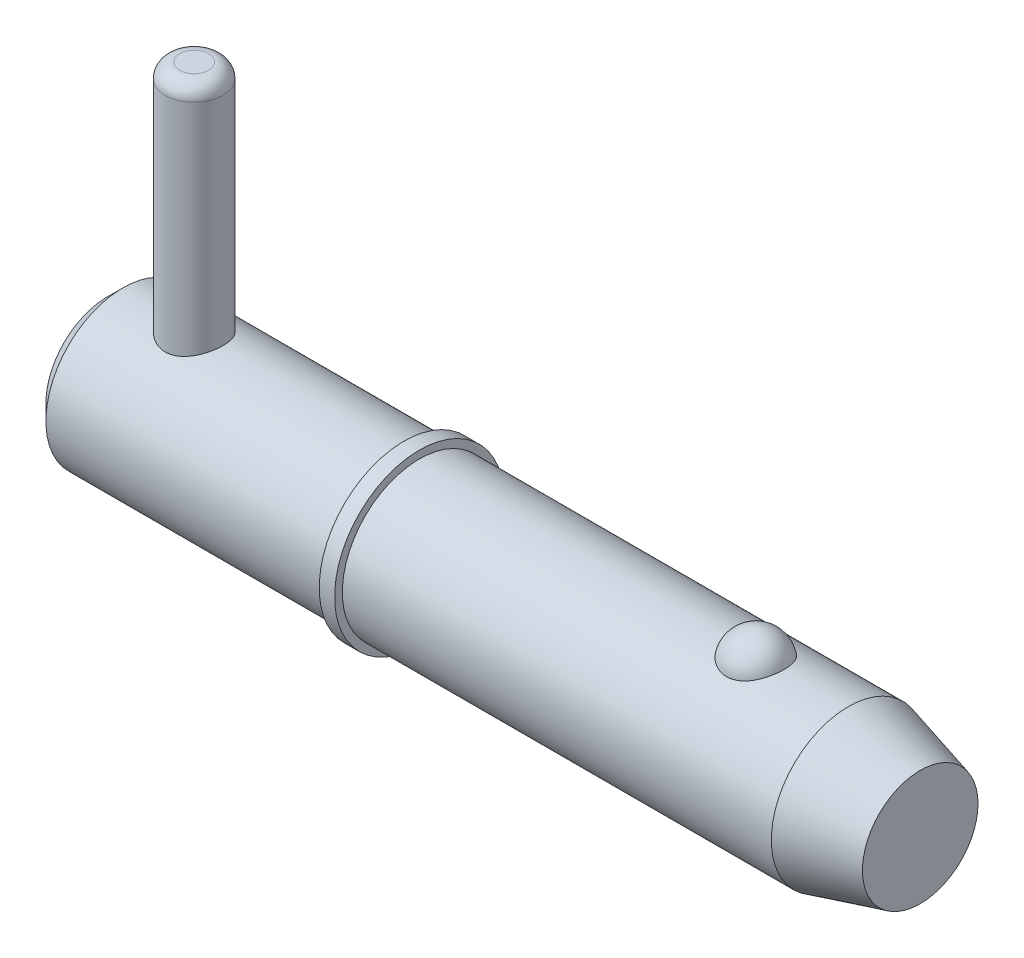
ISO-10303-21;
HEADER;
FILE_DESCRIPTION(('STEP AP214'),'2;1');
FILE_NAME('part.step','',(''),(''),'','','');
FILE_SCHEMA(('AUTOMOTIVE_DESIGN { 1 0 10303 214 1 1 1 1 }'));
ENDSEC;
DATA;
#1=APPLICATION_CONTEXT('core data for automotive mechanical design processes');
#2=APPLICATION_PROTOCOL_DEFINITION('international standard','automotive_design',2000,#1);
#3=PRODUCT_CONTEXT('',#1,'mechanical');
#4=PRODUCT('Part','Part','',(#3));
#5=PRODUCT_RELATED_PRODUCT_CATEGORY('part','',(#4));
#6=PRODUCT_DEFINITION_FORMATION('','',#4);
#7=PRODUCT_DEFINITION_CONTEXT('part definition',#1,'design');
#8=PRODUCT_DEFINITION('design','',#6,#7);
#9=PRODUCT_DEFINITION_SHAPE('','',#8);
#10=(LENGTH_UNIT() NAMED_UNIT(*) SI_UNIT(.MILLI.,.METRE.));
#11=(NAMED_UNIT(*) PLANE_ANGLE_UNIT() SI_UNIT($,.RADIAN.));
#12=(NAMED_UNIT(*) SI_UNIT($,.STERADIAN.) SOLID_ANGLE_UNIT());
#13=UNCERTAINTY_MEASURE_WITH_UNIT(LENGTH_MEASURE(1.E-05),#10,'distance_accuracy_value','');
#14=(GEOMETRIC_REPRESENTATION_CONTEXT(3) GLOBAL_UNCERTAINTY_ASSIGNED_CONTEXT((#13)) GLOBAL_UNIT_ASSIGNED_CONTEXT((#10,
#11,#12)) REPRESENTATION_CONTEXT('',''));
#15=CARTESIAN_POINT('',(0.,0.,0.));
#16=DIRECTION('',(0.,0.,1.));
#17=DIRECTION('',(1.,0.,0.));
#18=AXIS2_PLACEMENT_3D('',#15,#16,#17);
#19=CARTESIAN_POINT('',(7.14,25.4,0.));
#20=DIRECTION('',(0.,-1.,0.));
#21=DIRECTION('',(0.,0.,-1.));
#22=AXIS2_PLACEMENT_3D('',#19,#20,#21);
#23=CYLINDRICAL_SURFACE('',#22,2.38);
#24=CARTESIAN_POINT('',(7.14,-5.16,0.));
#25=DIRECTION('',(0.,1.,0.));
#26=DIRECTION('',(0.,0.,1.));
#27=AXIS2_PLACEMENT_3D('',#24,#25,#26);
#28=CIRCLE('',#27,2.38);
#29=CARTESIAN_POINT('',(7.14,-5.16,2.38));
#30=VERTEX_POINT('',#29);
#31=EDGE_CURVE('P0_E25',#30,#30,#28,.T.);
#32=ORIENTED_EDGE('',*,*,#31,.T.);
#33=EDGE_LOOP('',(#32));
#34=FACE_BOUND('',#33,.T.);
#35=CARTESIAN_POINT('',(7.14,24.21,0.));
#36=DIRECTION('',(0.,1.,0.));
#37=DIRECTION('',(0.,0.,1.));
#38=AXIS2_PLACEMENT_3D('',#35,#36,#37);
#39=CIRCLE('',#38,2.38);
#40=CARTESIAN_POINT('',(7.14,24.21,2.38));
#41=VERTEX_POINT('',#40);
#42=EDGE_CURVE('P0_E29',#41,#41,#39,.F.);
#43=ORIENTED_EDGE('',*,*,#42,.T.);
#44=EDGE_LOOP('',(#43));
#45=FACE_BOUND('',#44,.T.);
#46=ADVANCED_FACE('P0_F14',(#34,#45),#23,.T.);
#47=CARTESIAN_POINT('',(7.14,25.4,0.));
#48=DIRECTION('',(0.,1.,0.));
#49=DIRECTION('',(0.,0.,1.));
#50=AXIS2_PLACEMENT_3D('',#47,#48,#49);
#51=PLANE('',#50);
#52=CARTESIAN_POINT('',(7.14,25.4,0.));
#53=DIRECTION('',(0.,1.,0.));
#54=DIRECTION('',(0.,0.,1.));
#55=AXIS2_PLACEMENT_3D('',#52,#53,#54);
#56=CIRCLE('',#55,1.19);
#57=CARTESIAN_POINT('',(7.14,25.4,1.19));
#58=VERTEX_POINT('',#57);
#59=EDGE_CURVE('P0_E10',#58,#58,#56,.T.);
#60=ORIENTED_EDGE('',*,*,#59,.T.);
#61=EDGE_LOOP('',(#60));
#62=FACE_BOUND('',#61,.T.);
#63=ADVANCED_FACE('P0_F46',(#62),#51,.T.);
#64=CARTESIAN_POINT('',(7.14,-6.35,0.));
#65=DIRECTION('',(0.,1.,0.));
#66=DIRECTION('',(0.,0.,1.));
#67=AXIS2_PLACEMENT_3D('',#64,#65,#66);
#68=PLANE('',#67);
#69=CARTESIAN_POINT('',(7.14,-6.35,0.));
#70=DIRECTION('',(0.,1.,0.));
#71=DIRECTION('',(0.,0.,1.));
#72=AXIS2_PLACEMENT_3D('',#69,#70,#71);
#73=CIRCLE('',#72,1.19);
#74=CARTESIAN_POINT('',(7.14,-6.35,1.19));
#75=VERTEX_POINT('',#74);
#76=EDGE_CURVE('P0_E21',#75,#75,#73,.F.);
#77=ORIENTED_EDGE('',*,*,#76,.T.);
#78=EDGE_LOOP('',(#77));
#79=FACE_BOUND('',#78,.T.);
#80=ADVANCED_FACE('P0_F43',(#79),#68,.F.);
#81=CARTESIAN_POINT('',(7.14,-5.16,0.));
#82=DIRECTION('',(0.,1.,0.));
#83=DIRECTION('',(0.,0.,1.));
#84=AXIS2_PLACEMENT_3D('',#81,#82,#83);
#85=DEGENERATE_TOROIDAL_SURFACE('',#84,1.19,1.19,.T.);
#86=ORIENTED_EDGE('',*,*,#76,.F.);
#87=EDGE_LOOP('',(#86));
#88=FACE_BOUND('',#87,.T.);
#89=ORIENTED_EDGE('',*,*,#31,.F.);
#90=EDGE_LOOP('',(#89));
#91=FACE_BOUND('',#90,.T.);
#92=ADVANCED_FACE('P0_F38',(#88,#91),#85,.T.);
#93=CARTESIAN_POINT('',(7.14,24.21,0.));
#94=DIRECTION('',(0.,1.,0.));
#95=DIRECTION('',(0.,0.,1.));
#96=AXIS2_PLACEMENT_3D('',#93,#94,#95);
#97=DEGENERATE_TOROIDAL_SURFACE('',#96,1.19,1.19,.T.);
#98=ORIENTED_EDGE('',*,*,#42,.F.);
#99=EDGE_LOOP('',(#98));
#100=FACE_BOUND('',#99,.T.);
#101=ORIENTED_EDGE('',*,*,#59,.F.);
#102=EDGE_LOOP('',(#101));
#103=FACE_BOUND('',#102,.T.);
#104=ADVANCED_FACE('P0_F16',(#100,#103),#97,.T.);
#105=CLOSED_SHELL('',(#46,#63,#80,#92,#104));
#106=MANIFOLD_SOLID_BREP('P0_B1',#105);
#107=CARTESIAN_POINT('',(0.,0.,0.));
#108=DIRECTION('',(1.,0.,0.));
#109=DIRECTION('',(0.,0.,-1.));
#110=AXIS2_PLACEMENT_3D('',#107,#108,#109);
#111=CYLINDRICAL_SURFACE('',#110,6.35);
#112=CARTESIAN_POINT('',(61.0553693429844,0.,0.));
#113=DIRECTION('',(1.,0.,0.));
#114=DIRECTION('',(0.,0.,-1.));
#115=AXIS2_PLACEMENT_3D('',#112,#113,#114);
#116=CIRCLE('',#115,6.35);
#117=CARTESIAN_POINT('',(61.0553693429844,0.,-6.35));
#118=VERTEX_POINT('',#117);
#119=EDGE_CURVE('P1_E81',#118,#118,#116,.T.);
#120=ORIENTED_EDGE('',*,*,#119,.F.);
#121=EDGE_LOOP('',(#120));
#122=FACE_BOUND('',#121,.T.);
#123=CARTESIAN_POINT('',(25.7,0.,0.));
#124=DIRECTION('',(1.,0.,0.));
#125=DIRECTION('',(0.,0.,-1.));
#126=AXIS2_PLACEMENT_3D('',#123,#124,#125);
#127=CIRCLE('',#126,6.35);
#128=CARTESIAN_POINT('',(25.7,0.,-6.35));
#129=VERTEX_POINT('',#128);
#130=EDGE_CURVE('P1_E85',#129,#129,#127,.T.);
#131=ORIENTED_EDGE('',*,*,#130,.T.);
#132=EDGE_LOOP('',(#131));
#133=FACE_BOUND('',#132,.T.);
#134=CARTESIAN_POINT('',(53.4300214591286,5.87502187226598,2.40969251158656));
#135=CARTESIAN_POINT('',(53.3050305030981,5.87501645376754,2.40969773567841));
#136=CARTESIAN_POINT('',(53.1800806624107,5.87916061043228,2.39967292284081));
#137=CARTESIAN_POINT('',(52.9339091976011,5.89523112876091,2.35991730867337));
#138=CARTESIAN_POINT('',(52.8126863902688,5.90715499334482,2.33019283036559));
#139=CARTESIAN_POINT('',(52.5775170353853,5.9373956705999,2.25201402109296));
#140=CARTESIAN_POINT('',(52.4635602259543,5.95570321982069,2.20358681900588));
#141=CARTESIAN_POINT('',(52.24557352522,5.99672067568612,2.08937987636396));
#142=CARTESIAN_POINT('',(52.1415457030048,6.01943149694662,2.02359652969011));
#143=CARTESIAN_POINT('',(51.9429437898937,6.06760647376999,1.87428969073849));
#144=CARTESIAN_POINT('',(51.8487268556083,6.09313095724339,1.79031110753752));
#145=CARTESIAN_POINT('',(51.6752557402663,6.14375873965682,1.60800178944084));
#146=CARTESIAN_POINT('',(51.5960043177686,6.16886196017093,1.50966841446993));
#147=CARTESIAN_POINT('',(51.4508457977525,6.2172460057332,1.29645884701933));
#148=CARTESIAN_POINT('',(51.3856885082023,6.24039621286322,1.18104158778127));
#149=CARTESIAN_POINT('',(51.2747035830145,6.28117277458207,0.940351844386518));
#150=CARTESIAN_POINT('',(51.2288776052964,6.29879865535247,0.815078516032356));
#151=CARTESIAN_POINT('',(51.1570234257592,6.32692073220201,0.556494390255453));
#152=CARTESIAN_POINT('',(51.131249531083,6.33732517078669,0.423102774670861));
#153=CARTESIAN_POINT('',(51.1009885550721,6.34957673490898,0.153542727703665));
#154=CARTESIAN_POINT('',(51.0965009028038,6.35142408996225,0.0173743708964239));
#155=CARTESIAN_POINT('',(51.1088655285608,6.34638925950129,-0.253036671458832));
#156=CARTESIAN_POINT('',(51.1255949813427,6.33955731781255,-0.387285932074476));
#157=CARTESIAN_POINT('',(51.179843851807,6.31794129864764,-0.650851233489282));
#158=CARTESIAN_POINT('',(51.2173636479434,6.30315707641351,-0.780167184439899));
#159=CARTESIAN_POINT('',(51.312500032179,6.26711642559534,-1.03041949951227));
#160=CARTESIAN_POINT('',(51.370143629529,6.24585130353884,-1.1513443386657));
#161=CARTESIAN_POINT('',(51.5043522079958,6.19905619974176,-1.38129800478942));
#162=CARTESIAN_POINT('',(51.5809187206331,6.17352587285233,-1.49032586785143));
#163=CARTESIAN_POINT('',(51.7517538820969,6.12080227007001,-1.69393164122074));
#164=CARTESIAN_POINT('',(51.8461008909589,6.09360200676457,-1.78844209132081));
#165=CARTESIAN_POINT('',(52.0501196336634,6.0407043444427,-1.95970536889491));
#166=CARTESIAN_POINT('',(52.1597900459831,6.01500681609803,-2.03645972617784));
#167=CARTESIAN_POINT('',(52.3891876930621,5.96867714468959,-2.16845644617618));
#168=CARTESIAN_POINT('',(52.5086522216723,5.94794910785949,-2.22412062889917));
#169=CARTESIAN_POINT('',(52.7562188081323,5.91340580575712,-2.31440992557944));
#170=CARTESIAN_POINT('',(52.8843175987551,5.89958794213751,-2.34904294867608));
#171=CARTESIAN_POINT('',(53.138582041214,5.88111049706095,-2.39491590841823));
#172=CARTESIAN_POINT('',(53.2645207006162,5.876025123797,-2.40724512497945));
#173=CARTESIAN_POINT('',(53.5167867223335,5.87428980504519,-2.41147867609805));
#174=CARTESIAN_POINT('',(53.643114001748,5.87763817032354,-2.40338710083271));
#175=CARTESIAN_POINT('',(53.8884170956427,5.89212921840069,-2.36762715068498));
#176=CARTESIAN_POINT('',(54.0074992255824,5.90302431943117,-2.34058030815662));
#177=CARTESIAN_POINT('',(54.2392447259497,5.93113752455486,-2.2683906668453));
#178=CARTESIAN_POINT('',(54.3519075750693,5.94835614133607,-2.22324640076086));
#179=CARTESIAN_POINT('',(54.5704009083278,5.98773016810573,-2.11493806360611));
#180=CARTESIAN_POINT('',(54.6760289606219,6.00998499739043,-2.05140269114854));
#181=CARTESIAN_POINT('',(54.8753006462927,6.0569014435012,-1.90842705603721));
#182=CARTESIAN_POINT('',(54.9689415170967,6.08156361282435,-1.82898313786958));
#183=CARTESIAN_POINT('',(55.1466754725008,6.13211715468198,-1.65182429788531));
#184=CARTESIAN_POINT('',(55.230055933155,6.15800825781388,-1.55339381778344));
#185=CARTESIAN_POINT('',(55.3797900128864,6.20712834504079,-1.34374214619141));
#186=CARTESIAN_POINT('',(55.4461405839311,6.23035685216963,-1.23251867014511));
#187=CARTESIAN_POINT('',(55.5623455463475,6.27251177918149,-0.996447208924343));
#188=CARTESIAN_POINT('',(55.6116072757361,6.29127762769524,-0.871278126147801));
#189=CARTESIAN_POINT('',(55.6896142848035,6.3215862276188,-0.613870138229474));
#190=CARTESIAN_POINT('',(55.7183593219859,6.33312889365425,-0.481631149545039));
#191=CARTESIAN_POINT('',(55.7547705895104,6.34782349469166,-0.213672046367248));
#192=CARTESIAN_POINT('',(55.7624134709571,6.35096613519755,-0.0779482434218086));
#193=CARTESIAN_POINT('',(55.7563951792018,6.34851322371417,0.192943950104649));
#194=CARTESIAN_POINT('',(55.7427343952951,6.3429178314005,0.328112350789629));
#195=CARTESIAN_POINT('',(55.6945036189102,6.32360512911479,0.593406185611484));
#196=CARTESIAN_POINT('',(55.6600313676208,6.30992579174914,0.723552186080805));
#197=CARTESIAN_POINT('',(55.5709539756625,6.27586325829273,0.975834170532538));
#198=CARTESIAN_POINT('',(55.5163476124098,6.25547965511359,1.09796966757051));
#199=CARTESIAN_POINT('',(55.3877587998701,6.20998183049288,1.33148921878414));
#200=CARTESIAN_POINT('',(55.3136742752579,6.18484288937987,1.44281227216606));
#201=CARTESIAN_POINT('',(55.1478204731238,6.13258735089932,1.65087683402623));
#202=CARTESIAN_POINT('',(55.0560515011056,6.10547078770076,1.74761859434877));
#203=CARTESIAN_POINT('',(54.8571839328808,6.05235879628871,1.92350926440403));
#204=CARTESIAN_POINT('',(54.750133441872,6.02636017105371,2.00271146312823));
#205=CARTESIAN_POINT('',(54.5231384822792,5.97843747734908,2.14154159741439));
#206=CARTESIAN_POINT('',(54.403191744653,5.95651412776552,2.2011660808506));
#207=CARTESIAN_POINT('',(54.1445236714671,5.91812106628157,2.30250570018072));
#208=CARTESIAN_POINT('',(54.0050698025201,5.90217533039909,2.34256795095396));
#209=CARTESIAN_POINT('',(53.7203974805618,5.88063128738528,2.39615214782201));
#210=CARTESIAN_POINT('',(53.5751817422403,5.87502816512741,2.40968644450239));
#211=CARTESIAN_POINT('',(53.4300214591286,5.87502187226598,2.40969251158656));
#212=B_SPLINE_CURVE_WITH_KNOTS('',3,(#134,#135,#136,#137,#138,#139,#140,#141,#142,#143,#144,
#145,#146,#147,#148,#149,#150,#151,#152,#153,#154,#155,#156,#157,#158,#159,#160,#161,#162,#163,
#164,#165,#166,#167,#168,#169,#170,#171,#172,#173,#174,#175,#176,#177,#178,#179,#180,#181,#182,
#183,#184,#185,#186,#187,#188,#189,#190,#191,#192,#193,#194,#195,#196,#197,#198,#199,#200,#201,
#202,#203,#204,#205,#206,#207,#208,#209,#210,#211),.UNSPECIFIED.,.T.,.F.,(4,2,2,2,2,2,2,2,2,2,2,
2,2,2,2,2,2,2,2,2,2,2,2,2,2,2,2,2,2,2,2,2,2,2,2,2,2,2,4),(0.,0.374440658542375,
0.748761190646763,1.12254078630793,1.49639810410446,1.88098871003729,2.26565013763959,
2.66741104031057,3.0692063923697,3.47601794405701,3.88281858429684,4.28727498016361,
4.69173873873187,5.09674745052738,5.50178895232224,5.90865911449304,6.31549420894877,
6.71369855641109,7.11175305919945,7.48978077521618,7.86773278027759,8.23383886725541,
8.59997464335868,8.97409044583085,9.34829231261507,9.7412266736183,10.1342313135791,
10.539752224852,10.945277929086,11.3512521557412,11.7572189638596,12.1612938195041,
12.5653932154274,12.9716540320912,13.37790783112,13.782909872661,14.1879832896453,
14.6230486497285,15.0579114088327),.UNSPECIFIED.);
#213=CARTESIAN_POINT('',(53.4300214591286,5.87502187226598,2.40969251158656));
#214=VERTEX_POINT('',#213);
#215=EDGE_CURVE('P1_E35',#214,#214,#212,.T.);
#216=ORIENTED_EDGE('',*,*,#215,.T.);
#217=EDGE_LOOP('',(#216));
#218=FACE_BOUND('',#217,.T.);
#219=ADVANCED_FACE('P1_F13',(#122,#133,#218),#111,.T.);
#220=CARTESIAN_POINT('',(0.,0.,0.));
#221=DIRECTION('',(-1.,0.,0.));
#222=DIRECTION('',(0.,0.,1.));
#223=AXIS2_PLACEMENT_3D('',#220,#221,#222);
#224=PLANE('',#223);
#225=CARTESIAN_POINT('',(0.,0.,0.));
#226=DIRECTION('',(1.,0.,0.));
#227=DIRECTION('',(0.,0.,-1.));
#228=AXIS2_PLACEMENT_3D('',#225,#226,#227);
#229=CIRCLE('',#228,5.08);
#230=CARTESIAN_POINT('',(0.,0.,-5.08));
#231=VERTEX_POINT('',#230);
#232=EDGE_CURVE('P1_E9',#231,#231,#229,.T.);
#233=ORIENTED_EDGE('',*,*,#232,.F.);
#234=EDGE_LOOP('',(#233));
#235=FACE_BOUND('',#234,.T.);
#236=ADVANCED_FACE('P1_F15',(#235),#224,.T.);
#237=CARTESIAN_POINT('',(1.27,0.,0.));
#238=DIRECTION('',(1.,0.,0.));
#239=DIRECTION('',(0.,0.,-1.));
#240=AXIS2_PLACEMENT_3D('',#237,#238,#239);
#241=CONICAL_SURFACE('',#240,6.35,0.78539816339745);
#242=ORIENTED_EDGE('',*,*,#232,.T.);
#243=EDGE_LOOP('',(#242));
#244=FACE_BOUND('',#243,.T.);
#245=CARTESIAN_POINT('',(1.27,0.,0.));
#246=DIRECTION('',(1.,0.,0.));
#247=DIRECTION('',(0.,0.,-1.));
#248=AXIS2_PLACEMENT_3D('',#245,#246,#247);
#249=CIRCLE('',#248,6.35);
#250=CARTESIAN_POINT('',(1.27,0.,-6.35));
#251=VERTEX_POINT('',#250);
#252=EDGE_CURVE('P1_E26',#251,#251,#249,.T.);
#253=ORIENTED_EDGE('',*,*,#252,.F.);
#254=EDGE_LOOP('',(#253));
#255=FACE_BOUND('',#254,.T.);
#256=ADVANCED_FACE('P1_F77',(#244,#255),#241,.T.);
#257=CARTESIAN_POINT('',(0.,0.,0.));
#258=DIRECTION('',(1.,0.,0.));
#259=DIRECTION('',(0.,0.,-1.));
#260=AXIS2_PLACEMENT_3D('',#257,#258,#259);
#261=CYLINDRICAL_SURFACE('',#260,6.35);
#262=CARTESIAN_POINT('',(7.14,-5.88711304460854,2.38));
#263=CARTESIAN_POINT('',(7.01146258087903,-5.88710856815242,2.38000480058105));
#264=CARTESIAN_POINT('',(6.88295682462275,-5.89136840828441,2.36955244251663));
#265=CARTESIAN_POINT('',(6.62981934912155,-5.90782785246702,2.32820953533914));
#266=CARTESIAN_POINT('',(6.50518751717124,-5.92002722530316,2.29731958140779));
#267=CARTESIAN_POINT('',(6.26352403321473,-5.95079384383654,2.21639366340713));
#268=CARTESIAN_POINT('',(6.14647496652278,-5.96934583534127,2.16640353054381));
#269=CARTESIAN_POINT('',(5.92237941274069,-6.01070278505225,2.04885862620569));
#270=CARTESIAN_POINT('',(5.81533593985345,-6.03350901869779,1.98129858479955));
#271=CARTESIAN_POINT('',(5.60897525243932,-6.08207341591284,1.82693902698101));
#272=CARTESIAN_POINT('',(5.51022503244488,-6.10791836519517,1.73940861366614));
#273=CARTESIAN_POINT('',(5.32840561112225,-6.15892405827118,1.54914379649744));
#274=CARTESIAN_POINT('',(5.24533975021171,-6.1840846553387,1.44640616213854));
#275=CARTESIAN_POINT('',(5.09451639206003,-6.23191821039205,1.22434014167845));
#276=CARTESIAN_POINT('',(5.02737511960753,-6.25447755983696,1.10456656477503));
#277=CARTESIAN_POINT('',(4.91443001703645,-6.2935236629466,0.854429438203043));
#278=CARTESIAN_POINT('',(4.86861879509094,-6.31001251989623,0.724069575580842));
#279=CARTESIAN_POINT('',(4.80162253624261,-6.33444370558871,0.46242122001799));
#280=CARTESIAN_POINT('',(4.77946137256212,-6.34272370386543,0.331414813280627));
#281=CARTESIAN_POINT('',(4.75726677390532,-6.35101600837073,0.0672982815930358));
#282=CARTESIAN_POINT('',(4.75722615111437,-6.35103100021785,-0.0658111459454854));
#283=CARTESIAN_POINT('',(4.77870510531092,-6.3430064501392,-0.323358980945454));
#284=CARTESIAN_POINT('',(4.79915922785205,-6.33536494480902,-0.447900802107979));
#285=CARTESIAN_POINT('',(4.85925493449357,-6.31340794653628,-0.69163609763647));
#286=CARTESIAN_POINT('',(4.89889787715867,-6.29909198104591,-0.810829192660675));
#287=CARTESIAN_POINT('',(4.9967414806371,-6.26494471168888,-1.04254212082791));
#288=CARTESIAN_POINT('',(5.05520370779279,-6.24503620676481,-1.1549396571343));
#289=CARTESIAN_POINT('',(5.1887948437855,-6.20171869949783,-1.3686079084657));
#290=CARTESIAN_POINT('',(5.26392912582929,-6.17830856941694,-1.46987502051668));
#291=CARTESIAN_POINT('',(5.43386591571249,-6.12878580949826,-1.66468415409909));
#292=CARTESIAN_POINT('',(5.52956139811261,-6.10259519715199,-1.75742857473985));
#293=CARTESIAN_POINT('',(5.73530435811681,-6.05155777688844,-1.92585331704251));
#294=CARTESIAN_POINT('',(5.84535542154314,-6.02671130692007,-2.00152936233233));
#295=CARTESIAN_POINT('',(6.07982989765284,-5.98068420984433,-2.13519109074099));
#296=CARTESIAN_POINT('',(6.20451768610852,-5.95959698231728,-2.19274775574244));
#297=CARTESIAN_POINT('',(6.4628145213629,-5.92455622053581,-2.28574558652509));
#298=CARTESIAN_POINT('',(6.59641856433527,-5.91059872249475,-2.32119904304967));
#299=CARTESIAN_POINT('',(6.86087441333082,-5.8923327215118,-2.36717069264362));
#300=CARTESIAN_POINT('',(6.99147192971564,-5.8875347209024,-2.37895573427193));
#301=CARTESIAN_POINT('',(7.25283805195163,-5.88674545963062,-2.38091046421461));
#302=CARTESIAN_POINT('',(7.38360660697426,-5.89075200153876,-2.37108554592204));
#303=CARTESIAN_POINT('',(7.63510696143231,-5.90662331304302,-2.33124781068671));
#304=CARTESIAN_POINT('',(7.75602069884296,-5.91810660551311,-2.30221396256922));
#305=CARTESIAN_POINT('',(7.99120505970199,-5.94718527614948,-2.22601401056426));
#306=CARTESIAN_POINT('',(8.10547431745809,-5.96478190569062,-2.17884419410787));
#307=CARTESIAN_POINT('',(8.32888632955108,-6.00491533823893,-2.06572311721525));
#308=CARTESIAN_POINT('',(8.43767672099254,-6.02761250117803,-1.99913452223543));
#309=CARTESIAN_POINT('',(8.6429894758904,-6.07511988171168,-1.84974438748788));
#310=CARTESIAN_POINT('',(8.73950733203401,-6.09993087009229,-1.76693691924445));
#311=CARTESIAN_POINT('',(8.9238741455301,-6.1507686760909,-1.58125563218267));
#312=CARTESIAN_POINT('',(9.01078732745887,-6.17677301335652,-1.47744327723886));
#313=CARTESIAN_POINT('',(9.16607127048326,-6.22556172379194,-1.25606967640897));
#314=CARTESIAN_POINT('',(9.23444197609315,-6.24834608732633,-1.13850838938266));
#315=CARTESIAN_POINT('',(9.3502493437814,-6.28811144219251,-0.893050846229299));
#316=CARTESIAN_POINT('',(9.39775808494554,-6.30511236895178,-0.765192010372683));
#317=CARTESIAN_POINT('',(9.47032640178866,-6.33145833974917,-0.502514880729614));
#318=CARTESIAN_POINT('',(9.49539651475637,-6.34080697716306,-0.367699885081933));
#319=CARTESIAN_POINT('',(9.52124059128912,-6.35045496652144,-0.103396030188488));
#320=CARTESIAN_POINT('',(9.52334421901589,-6.35124952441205,0.025945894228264));
#321=CARTESIAN_POINT('',(9.50661518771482,-6.34499064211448,0.283061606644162));
#322=CARTESIAN_POINT('',(9.48778504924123,-6.33793814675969,0.410835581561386));
#323=CARTESIAN_POINT('',(9.43065630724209,-6.31700307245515,0.658028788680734));
#324=CARTESIAN_POINT('',(9.39284291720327,-6.30329098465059,0.7775756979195));
#325=CARTESIAN_POINT('',(9.29930406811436,-6.27046903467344,1.00863789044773));
#326=CARTESIAN_POINT('',(9.2435752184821,-6.25135815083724,1.12015164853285));
#327=CARTESIAN_POINT('',(9.11312349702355,-6.20865254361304,1.33711407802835));
#328=CARTESIAN_POINT('',(9.03770094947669,-6.18490316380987,1.44211105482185));
#329=CARTESIAN_POINT('',(8.87110640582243,-6.13583718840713,1.63836897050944));
#330=CARTESIAN_POINT('',(8.77992879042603,-6.11052003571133,1.72962498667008));
#331=CARTESIAN_POINT('',(8.57869799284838,-6.05953829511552,1.90076098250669));
#332=CARTESIAN_POINT('',(8.46790320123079,-6.03392573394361,1.97978778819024));
#333=CARTESIAN_POINT('',(8.23379693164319,-5.98676607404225,2.11813466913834));
#334=CARTESIAN_POINT('',(8.11048418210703,-5.9652193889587,2.17745273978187));
#335=CARTESIAN_POINT('',(7.84900037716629,-5.92818393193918,2.27641807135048));
#336=CARTESIAN_POINT('',(7.71041678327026,-5.91299857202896,2.31510015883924));
#337=CARTESIAN_POINT('',(7.42787316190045,-5.89246887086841,2.36688002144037));
#338=CARTESIAN_POINT('',(7.28391673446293,-5.88711805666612,2.37999462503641));
#339=CARTESIAN_POINT('',(7.14,-5.88711304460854,2.38));
#340=B_SPLINE_CURVE_WITH_KNOTS('',3,(#262,#263,#264,#265,#266,#267,#268,#269,#270,#271,#272,
#273,#274,#275,#276,#277,#278,#279,#280,#281,#282,#283,#284,#285,#286,#287,#288,#289,#290,#291,
#292,#293,#294,#295,#296,#297,#298,#299,#300,#301,#302,#303,#304,#305,#306,#307,#308,#309,#310,
#311,#312,#313,#314,#315,#316,#317,#318,#319,#320,#321,#322,#323,#324,#325,#326,#327,#328,#329,
#330,#331,#332,#333,#334,#335,#336,#337,#338,#339),.UNSPECIFIED.,.T.,.F.,(4,2,2,2,2,2,2,2,2,2,2,
2,2,2,2,2,2,2,2,2,2,2,2,2,2,2,2,2,2,2,2,2,2,2,2,2,2,2,4),(0.,0.385076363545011,
0.770141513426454,1.15428843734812,1.53855071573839,1.94016118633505,2.3418570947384,
2.75720522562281,3.1724093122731,3.569721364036,3.96690431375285,4.34445758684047,
4.72203759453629,5.10511017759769,5.48830640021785,5.89390240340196,6.29959991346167,
6.71428455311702,7.12873839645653,7.52034494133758,7.91185376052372,8.28480528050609,
8.65783318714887,9.0448340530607,9.43197664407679,9.84363087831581,10.2552863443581,
10.6655081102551,11.0755371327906,11.4616919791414,11.847800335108,12.224507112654,
12.6012852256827,12.9938941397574,13.386643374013,13.8000944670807,14.2135876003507,
14.6450218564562,15.0761720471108),.UNSPECIFIED.);
#341=CARTESIAN_POINT('',(7.14,-5.88711304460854,2.38));
#342=VERTEX_POINT('',#341);
#343=EDGE_CURVE('P1_E17',#342,#342,#340,.T.);
#344=ORIENTED_EDGE('',*,*,#343,.F.);
#345=EDGE_LOOP('',(#344));
#346=FACE_BOUND('',#345,.T.);
#347=CARTESIAN_POINT('',(7.14,5.88711304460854,2.38));
#348=CARTESIAN_POINT('',(7.26853741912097,5.88710856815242,2.38000480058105));
#349=CARTESIAN_POINT('',(7.39704317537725,5.89136840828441,2.36955244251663));
#350=CARTESIAN_POINT('',(7.65018065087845,5.90782785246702,2.32820953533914));
#351=CARTESIAN_POINT('',(7.77481248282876,5.92002722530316,2.29731958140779));
#352=CARTESIAN_POINT('',(8.01647596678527,5.95079384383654,2.21639366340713));
#353=CARTESIAN_POINT('',(8.13352503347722,5.96934583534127,2.16640353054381));
#354=CARTESIAN_POINT('',(8.35762058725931,6.01070278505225,2.04885862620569));
#355=CARTESIAN_POINT('',(8.46466406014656,6.03350901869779,1.98129858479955));
#356=CARTESIAN_POINT('',(8.67102474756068,6.08207341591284,1.82693902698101));
#357=CARTESIAN_POINT('',(8.76977496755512,6.10791836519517,1.73940861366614));
#358=CARTESIAN_POINT('',(8.95159438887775,6.15892405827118,1.54914379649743));
#359=CARTESIAN_POINT('',(9.03466024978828,6.1840846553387,1.44640616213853));
#360=CARTESIAN_POINT('',(9.18548360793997,6.23191821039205,1.22434014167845));
#361=CARTESIAN_POINT('',(9.25262488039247,6.25447755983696,1.10456656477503));
#362=CARTESIAN_POINT('',(9.36556998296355,6.2935236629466,0.854429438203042));
#363=CARTESIAN_POINT('',(9.41138120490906,6.31001251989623,0.72406957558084));
#364=CARTESIAN_POINT('',(9.47837746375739,6.33444370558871,0.462421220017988));
#365=CARTESIAN_POINT('',(9.50053862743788,6.34272370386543,0.331414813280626));
#366=CARTESIAN_POINT('',(9.52273322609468,6.35101600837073,0.0672982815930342));
#367=CARTESIAN_POINT('',(9.52277384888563,6.35103100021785,-0.0658111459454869));
#368=CARTESIAN_POINT('',(9.50129489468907,6.3430064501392,-0.323358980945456));
#369=CARTESIAN_POINT('',(9.48084077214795,6.33536494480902,-0.447900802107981));
#370=CARTESIAN_POINT('',(9.42074506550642,6.31340794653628,-0.691636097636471));
#371=CARTESIAN_POINT('',(9.38110212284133,6.29909198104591,-0.810829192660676));
#372=CARTESIAN_POINT('',(9.2832585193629,6.26494471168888,-1.04254212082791));
#373=CARTESIAN_POINT('',(9.22479629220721,6.24503620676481,-1.1549396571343));
#374=CARTESIAN_POINT('',(9.0912051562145,6.20171869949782,-1.3686079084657));
#375=CARTESIAN_POINT('',(9.0160708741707,6.17830856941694,-1.46987502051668));
#376=CARTESIAN_POINT('',(8.84613408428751,6.12878580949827,-1.66468415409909));
#377=CARTESIAN_POINT('',(8.75043860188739,6.10259519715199,-1.75742857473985));
#378=CARTESIAN_POINT('',(8.54469564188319,6.05155777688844,-1.92585331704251));
#379=CARTESIAN_POINT('',(8.43464457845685,6.02671130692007,-2.00152936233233));
#380=CARTESIAN_POINT('',(8.20017010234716,5.98068420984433,-2.13519109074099));
#381=CARTESIAN_POINT('',(8.07548231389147,5.95959698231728,-2.19274775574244));
#382=CARTESIAN_POINT('',(7.8171854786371,5.9245562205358,-2.28574558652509));
#383=CARTESIAN_POINT('',(7.68358143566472,5.91059872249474,-2.32119904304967));
#384=CARTESIAN_POINT('',(7.41912558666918,5.8923327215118,-2.36717069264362));
#385=CARTESIAN_POINT('',(7.28852807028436,5.8875347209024,-2.37895573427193));
#386=CARTESIAN_POINT('',(7.02716194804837,5.88674545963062,-2.38091046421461));
#387=CARTESIAN_POINT('',(6.89639339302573,5.89075200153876,-2.37108554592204));
#388=CARTESIAN_POINT('',(6.64489303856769,5.90662331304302,-2.33124781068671));
#389=CARTESIAN_POINT('',(6.52397930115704,5.91810660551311,-2.30221396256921));
#390=CARTESIAN_POINT('',(6.288794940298,5.94718527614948,-2.22601401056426));
#391=CARTESIAN_POINT('',(6.17452568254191,5.96478190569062,-2.17884419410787));
#392=CARTESIAN_POINT('',(5.95111367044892,6.00491533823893,-2.06572311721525));
#393=CARTESIAN_POINT('',(5.84232327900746,6.02761250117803,-1.99913452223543));
#394=CARTESIAN_POINT('',(5.6370105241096,6.07511988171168,-1.84974438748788));
#395=CARTESIAN_POINT('',(5.54049266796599,6.09993087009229,-1.76693691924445));
#396=CARTESIAN_POINT('',(5.3561258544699,6.1507686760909,-1.58125563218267));
#397=CARTESIAN_POINT('',(5.26921267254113,6.17677301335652,-1.47744327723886));
#398=CARTESIAN_POINT('',(5.11392872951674,6.22556172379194,-1.25606967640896));
#399=CARTESIAN_POINT('',(5.04555802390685,6.24834608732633,-1.13850838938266));
#400=CARTESIAN_POINT('',(4.9297506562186,6.28811144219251,-0.893050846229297));
#401=CARTESIAN_POINT('',(4.88224191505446,6.30511236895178,-0.76519201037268));
#402=CARTESIAN_POINT('',(4.80967359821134,6.33145833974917,-0.502514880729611));
#403=CARTESIAN_POINT('',(4.78460348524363,6.34080697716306,-0.36769988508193));
#404=CARTESIAN_POINT('',(4.75875940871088,6.35045496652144,-0.103396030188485));
#405=CARTESIAN_POINT('',(4.75665578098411,6.35124952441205,0.025945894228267));
#406=CARTESIAN_POINT('',(4.77338481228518,6.34499064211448,0.283061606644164));
#407=CARTESIAN_POINT('',(4.79221495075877,6.33793814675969,0.410835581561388));
#408=CARTESIAN_POINT('',(4.84934369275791,6.31700307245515,0.658028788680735));
#409=CARTESIAN_POINT('',(4.88715708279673,6.30329098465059,0.777575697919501));
#410=CARTESIAN_POINT('',(4.98069593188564,6.27046903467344,1.00863789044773));
#411=CARTESIAN_POINT('',(5.0364247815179,6.25135815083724,1.12015164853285));
#412=CARTESIAN_POINT('',(5.16687650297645,6.20865254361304,1.33711407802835));
#413=CARTESIAN_POINT('',(5.24229905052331,6.18490316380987,1.44211105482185));
#414=CARTESIAN_POINT('',(5.40889359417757,6.13583718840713,1.63836897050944));
#415=CARTESIAN_POINT('',(5.50007120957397,6.11052003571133,1.72962498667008));
#416=CARTESIAN_POINT('',(5.70130200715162,6.05953829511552,1.90076098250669));
#417=CARTESIAN_POINT('',(5.81209679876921,6.03392573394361,1.97978778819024));
#418=CARTESIAN_POINT('',(6.04620306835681,5.98676607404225,2.11813466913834));
#419=CARTESIAN_POINT('',(6.16951581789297,5.9652193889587,2.17745273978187));
#420=CARTESIAN_POINT('',(6.43099962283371,5.92818393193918,2.27641807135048));
#421=CARTESIAN_POINT('',(6.56958321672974,5.91299857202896,2.31510015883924));
#422=CARTESIAN_POINT('',(6.85212683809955,5.89246887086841,2.36688002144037));
#423=CARTESIAN_POINT('',(6.99608326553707,5.88711805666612,2.37999462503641));
#424=CARTESIAN_POINT('',(7.14,5.88711304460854,2.38));
#425=B_SPLINE_CURVE_WITH_KNOTS('',3,(#347,#348,#349,#350,#351,#352,#353,#354,#355,#356,#357,
#358,#359,#360,#361,#362,#363,#364,#365,#366,#367,#368,#369,#370,#371,#372,#373,#374,#375,#376,
#377,#378,#379,#380,#381,#382,#383,#384,#385,#386,#387,#388,#389,#390,#391,#392,#393,#394,#395,
#396,#397,#398,#399,#400,#401,#402,#403,#404,#405,#406,#407,#408,#409,#410,#411,#412,#413,#414,
#415,#416,#417,#418,#419,#420,#421,#422,#423,#424),.UNSPECIFIED.,.T.,.F.,(4,2,2,2,2,2,2,2,2,2,2,
2,2,2,2,2,2,2,2,2,2,2,2,2,2,2,2,2,2,2,2,2,2,2,2,2,2,2,4),(0.,0.385076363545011,
0.770141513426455,1.15428843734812,1.53855071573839,1.94016118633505,2.3418570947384,
2.75720522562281,3.1724093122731,3.56972136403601,3.96690431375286,4.34445758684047,
4.72203759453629,5.10511017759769,5.48830640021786,5.89390240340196,6.29959991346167,
6.71428455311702,7.12873839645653,7.52034494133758,7.91185376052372,8.2848052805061,
8.65783318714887,9.0448340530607,9.43197664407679,9.84363087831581,10.2552863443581,
10.6655081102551,11.0755371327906,11.4616919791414,11.847800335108,12.2245071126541,
12.6012852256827,12.9938941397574,13.386643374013,13.8000944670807,14.2135876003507,
14.6450218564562,15.0761720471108),.UNSPECIFIED.);
#426=CARTESIAN_POINT('',(7.14,5.88711304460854,2.38));
#427=VERTEX_POINT('',#426);
#428=EDGE_CURVE('P1_E43',#427,#427,#425,.T.);
#429=ORIENTED_EDGE('',*,*,#428,.F.);
#430=EDGE_LOOP('',(#429));
#431=FACE_BOUND('',#430,.T.);
#432=ORIENTED_EDGE('',*,*,#252,.T.);
#433=EDGE_LOOP('',(#432));
#434=FACE_BOUND('',#433,.T.);
#435=CARTESIAN_POINT('',(24.43,0.,0.));
#436=DIRECTION('',(1.,0.,0.));
#437=DIRECTION('',(0.,0.,-1.));
#438=AXIS2_PLACEMENT_3D('',#435,#436,#437);
#439=CIRCLE('',#438,6.35);
#440=CARTESIAN_POINT('',(24.43,0.,-6.35));
#441=VERTEX_POINT('',#440);
#442=EDGE_CURVE('P1_E31',#441,#441,#439,.T.);
#443=ORIENTED_EDGE('',*,*,#442,.F.);
#444=EDGE_LOOP('',(#443));
#445=FACE_BOUND('',#444,.T.);
#446=ADVANCED_FACE('P1_F103',(#346,#431,#434,#445),#261,.T.);
#447=CARTESIAN_POINT('',(24.43,6.35,0.));
#448=DIRECTION('',(-1.,0.,0.));
#449=DIRECTION('',(0.,0.,1.));
#450=AXIS2_PLACEMENT_3D('',#447,#448,#449);
#451=PLANE('',#450);
#452=ORIENTED_EDGE('',*,*,#442,.T.);
#453=EDGE_LOOP('',(#452));
#454=FACE_BOUND('',#453,.T.);
#455=CARTESIAN_POINT('',(24.43,0.,0.));
#456=DIRECTION('',(1.,0.,0.));
#457=DIRECTION('',(0.,0.,-1.));
#458=AXIS2_PLACEMENT_3D('',#455,#456,#457);
#459=CIRCLE('',#458,6.985);
#460=CARTESIAN_POINT('',(24.43,0.,-6.985));
#461=VERTEX_POINT('',#460);
#462=EDGE_CURVE('P1_E91',#461,#461,#459,.T.);
#463=ORIENTED_EDGE('',*,*,#462,.F.);
#464=EDGE_LOOP('',(#463));
#465=FACE_BOUND('',#464,.T.);
#466=ADVANCED_FACE('P1_F100',(#454,#465),#451,.T.);
#467=CARTESIAN_POINT('',(0.,0.,0.));
#468=DIRECTION('',(1.,0.,0.));
#469=DIRECTION('',(0.,0.,-1.));
#470=AXIS2_PLACEMENT_3D('',#467,#468,#469);
#471=CYLINDRICAL_SURFACE('',#470,6.985);
#472=ORIENTED_EDGE('',*,*,#462,.T.);
#473=EDGE_LOOP('',(#472));
#474=FACE_BOUND('',#473,.T.);
#475=CARTESIAN_POINT('',(25.7,0.,0.));
#476=DIRECTION('',(1.,0.,0.));
#477=DIRECTION('',(0.,0.,-1.));
#478=AXIS2_PLACEMENT_3D('',#475,#476,#477);
#479=CIRCLE('',#478,6.985);
#480=CARTESIAN_POINT('',(25.7,0.,-6.985));
#481=VERTEX_POINT('',#480);
#482=EDGE_CURVE('P1_E88',#481,#481,#479,.T.);
#483=ORIENTED_EDGE('',*,*,#482,.F.);
#484=EDGE_LOOP('',(#483));
#485=FACE_BOUND('',#484,.T.);
#486=ADVANCED_FACE('P1_F68',(#474,#485),#471,.T.);
#487=CARTESIAN_POINT('',(25.7,6.985,0.));
#488=DIRECTION('',(1.,0.,0.));
#489=DIRECTION('',(0.,0.,-1.));
#490=AXIS2_PLACEMENT_3D('',#487,#488,#489);
#491=PLANE('',#490);
#492=ORIENTED_EDGE('',*,*,#482,.T.);
#493=EDGE_LOOP('',(#492));
#494=FACE_BOUND('',#493,.T.);
#495=ORIENTED_EDGE('',*,*,#130,.F.);
#496=EDGE_LOOP('',(#495));
#497=FACE_BOUND('',#496,.T.);
#498=ADVANCED_FACE('P1_F62',(#494,#497),#491,.T.);
#499=CARTESIAN_POINT('',(66.98,0.,0.));
#500=DIRECTION('',(-1.,0.,0.));
#501=DIRECTION('',(0.,0.,1.));
#502=AXIS2_PLACEMENT_3D('',#499,#500,#501);
#503=CONICAL_SURFACE('',#502,4.76250000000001,0.26179938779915);
#504=ORIENTED_EDGE('',*,*,#119,.T.);
#505=EDGE_LOOP('',(#504));
#506=FACE_BOUND('',#505,.T.);
#507=CARTESIAN_POINT('',(66.98,0.,0.));
#508=DIRECTION('',(1.,0.,0.));
#509=DIRECTION('',(0.,0.,-1.));
#510=AXIS2_PLACEMENT_3D('',#507,#508,#509);
#511=CIRCLE('',#510,4.76250000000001);
#512=CARTESIAN_POINT('',(66.98,0.,-4.76250000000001));
#513=VERTEX_POINT('',#512);
#514=EDGE_CURVE('P1_E42',#513,#513,#511,.T.);
#515=ORIENTED_EDGE('',*,*,#514,.F.);
#516=EDGE_LOOP('',(#515));
#517=FACE_BOUND('',#516,.T.);
#518=ADVANCED_FACE('P1_F59',(#506,#517),#503,.T.);
#519=CARTESIAN_POINT('',(66.98,4.76250000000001,0.));
#520=DIRECTION('',(1.,0.,0.));
#521=DIRECTION('',(0.,0.,-1.));
#522=AXIS2_PLACEMENT_3D('',#519,#520,#521);
#523=PLANE('',#522);
#524=ORIENTED_EDGE('',*,*,#514,.T.);
#525=EDGE_LOOP('',(#524));
#526=FACE_BOUND('',#525,.T.);
#527=ADVANCED_FACE('P1_F55',(#526),#523,.T.);
#528=CARTESIAN_POINT('',(53.4300214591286,5.715,0.));
#529=DIRECTION('',(-1.,0.,0.));
#530=DIRECTION('',(0.,1.,0.));
#531=AXIS2_PLACEMENT_3D('',#528,#529,#530);
#532=SPHERICAL_SURFACE('',#531,2.41499999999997);
#533=ORIENTED_EDGE('',*,*,#215,.F.);
#534=EDGE_LOOP('',(#533));
#535=FACE_BOUND('',#534,.T.);
#536=ADVANCED_FACE('P1_F50',(#535),#532,.T.);
#537=CARTESIAN_POINT('',(7.14,-6.985,0.));
#538=DIRECTION('',(0.,1.,0.));
#539=DIRECTION('',(0.,0.,1.));
#540=AXIS2_PLACEMENT_3D('',#537,#538,#539);
#541=CYLINDRICAL_SURFACE('',#540,2.38);
#542=ORIENTED_EDGE('',*,*,#343,.T.);
#543=EDGE_LOOP('',(#542));
#544=FACE_BOUND('',#543,.T.);
#545=ORIENTED_EDGE('',*,*,#428,.T.);
#546=EDGE_LOOP('',(#545));
#547=FACE_BOUND('',#546,.T.);
#548=ADVANCED_FACE('P1_F54',(#544,#547),#541,.F.);
#549=CLOSED_SHELL('',(#219,#236,#256,#446,#466,#486,#498,#518,#527,#536,#548));
#550=MANIFOLD_SOLID_BREP('P1_B1',#549);
#551=ADVANCED_BREP_SHAPE_REPRESENTATION('',(#18,#106,#550),#14);
#552=SHAPE_DEFINITION_REPRESENTATION(#9,#551);
ENDSEC;
END-ISO-10303-21;
